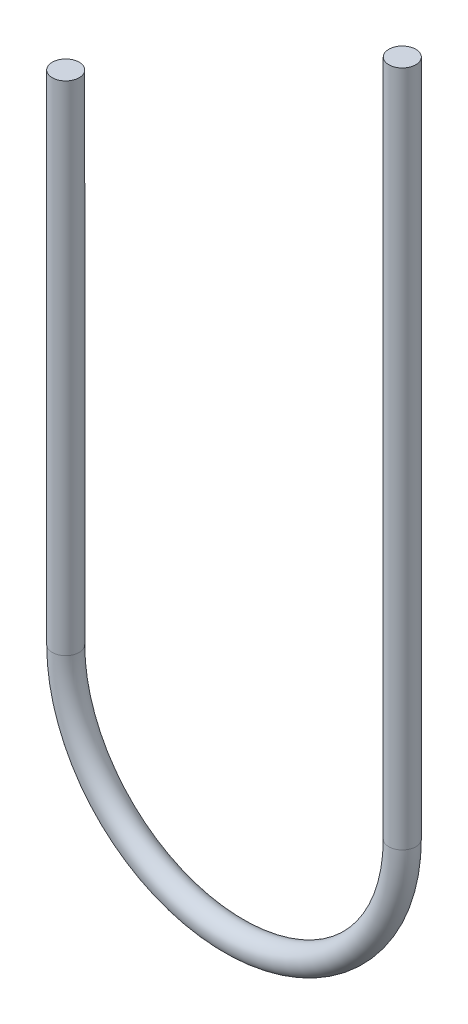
ISO-10303-21;
HEADER;
FILE_DESCRIPTION(('STEP AP214'),'2;1');
FILE_NAME('part.step','',(''),(''),'','','');
FILE_SCHEMA(('AUTOMOTIVE_DESIGN { 1 0 10303 214 1 1 1 1 }'));
ENDSEC;
DATA;
#1=APPLICATION_CONTEXT('core data for automotive mechanical design processes');
#2=APPLICATION_PROTOCOL_DEFINITION('international standard','automotive_design',2000,#1);
#3=PRODUCT_CONTEXT('',#1,'mechanical');
#4=PRODUCT('Part','Part','',(#3));
#5=PRODUCT_RELATED_PRODUCT_CATEGORY('part','',(#4));
#6=PRODUCT_DEFINITION_FORMATION('','',#4);
#7=PRODUCT_DEFINITION_CONTEXT('part definition',#1,'design');
#8=PRODUCT_DEFINITION('design','',#6,#7);
#9=PRODUCT_DEFINITION_SHAPE('','',#8);
#10=(LENGTH_UNIT() NAMED_UNIT(*) SI_UNIT(.MILLI.,.METRE.));
#11=(NAMED_UNIT(*) PLANE_ANGLE_UNIT() SI_UNIT($,.RADIAN.));
#12=(NAMED_UNIT(*) SI_UNIT($,.STERADIAN.) SOLID_ANGLE_UNIT());
#13=UNCERTAINTY_MEASURE_WITH_UNIT(LENGTH_MEASURE(1.E-05),#10,'distance_accuracy_value','');
#14=(GEOMETRIC_REPRESENTATION_CONTEXT(3) GLOBAL_UNCERTAINTY_ASSIGNED_CONTEXT((#13)) GLOBAL_UNIT_ASSIGNED_CONTEXT((#10,
#11,#12)) REPRESENTATION_CONTEXT('',''));
#15=CARTESIAN_POINT('',(0.,0.,0.));
#16=DIRECTION('',(0.,0.,1.));
#17=DIRECTION('',(1.,0.,0.));
#18=AXIS2_PLACEMENT_3D('',#15,#16,#17);
#19=CARTESIAN_POINT('',(-57.1499999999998,-229.7719948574,0.));
#20=DIRECTION('',(0.,1.,0.));
#21=DIRECTION('',(-1.,0.,0.));
#22=AXIS2_PLACEMENT_3D('',#19,#20,#21);
#23=CYLINDRICAL_SURFACE('',#22,3.80999999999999);
#24=CARTESIAN_POINT('',(-57.1499999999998,-229.7719948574,0.));
#25=DIRECTION('',(0.,1.,0.));
#26=DIRECTION('',(0.,0.,-1.));
#27=AXIS2_PLACEMENT_3D('',#24,#25,#26);
#28=CIRCLE('',#27,3.80999999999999);
#29=CARTESIAN_POINT('',(-60.9599999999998,-229.7719948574,0.));
#30=VERTEX_POINT('',#29);
#31=EDGE_CURVE('E35',#30,#30,#28,.T.);
#32=ORIENTED_EDGE('',*,*,#31,.T.);
#33=EDGE_LOOP('',(#32));
#34=FACE_BOUND('',#33,.T.);
#35=CARTESIAN_POINT('',(-57.1499999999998,-88.9,0.));
#36=DIRECTION('',(0.,1.,0.));
#37=DIRECTION('',(0.,0.,-1.));
#38=AXIS2_PLACEMENT_3D('',#35,#36,#37);
#39=CIRCLE('',#38,3.80999999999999);
#40=CARTESIAN_POINT('',(-57.1499999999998,-88.9,-3.81000000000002));
#41=VERTEX_POINT('',#40);
#42=EDGE_CURVE('E10',#41,#41,#39,.T.);
#43=ORIENTED_EDGE('',*,*,#42,.F.);
#44=EDGE_LOOP('',(#43));
#45=FACE_BOUND('',#44,.T.);
#46=ADVANCED_FACE('F29',(#34,#45),#23,.T.);
#47=CARTESIAN_POINT('',(-9.52499999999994,-229.7719948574,0.));
#48=DIRECTION('',(0.,0.,-1.));
#49=DIRECTION('',(-1.,0.,0.));
#50=AXIS2_PLACEMENT_3D('',#47,#48,#49);
#51=TOROIDAL_SURFACE('',#50,47.6249999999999,3.80999999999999);
#52=CARTESIAN_POINT('',(38.0999999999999,-229.7719948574,0.));
#53=DIRECTION('',(0.,-1.,0.));
#54=DIRECTION('',(0.,0.,-1.));
#55=AXIS2_PLACEMENT_3D('',#52,#53,#54);
#56=CIRCLE('',#55,3.80999999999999);
#57=CARTESIAN_POINT('',(41.9099999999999,-229.7719948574,0.));
#58=VERTEX_POINT('',#57);
#59=EDGE_CURVE('E39',#58,#58,#56,.T.);
#60=CARTESIAN_POINT('',(-9.52499999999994,-229.7719948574,0.));
#61=DIRECTION('',(0.,0.,-1.));
#62=DIRECTION('',(-1.,0.,0.));
#63=AXIS2_PLACEMENT_3D('',#60,#61,#62);
#64=CIRCLE('',#63,51.4349999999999);
#65=EDGE_CURVE('',#58,#30,#64,.T.);
#66=ORIENTED_EDGE('',*,*,#59,.T.);
#67=ORIENTED_EDGE('',*,*,#31,.F.);
#68=ORIENTED_EDGE('',*,*,#65,.T.);
#69=ORIENTED_EDGE('',*,*,#65,.F.);
#70=EDGE_LOOP('',(#66,#68,#67,#69));
#71=FACE_BOUND('',#70,.T.);
#72=ADVANCED_FACE('F61',(#71),#51,.T.);
#73=CARTESIAN_POINT('',(38.0999999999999,-229.7719948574,0.));
#74=DIRECTION('',(0.,1.,0.));
#75=DIRECTION('',(0.,0.,1.));
#76=AXIS2_PLACEMENT_3D('',#73,#74,#75);
#77=CYLINDRICAL_SURFACE('',#76,3.80999999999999);
#78=ORIENTED_EDGE('',*,*,#59,.F.);
#79=EDGE_LOOP('',(#78));
#80=FACE_BOUND('',#79,.T.);
#81=CARTESIAN_POINT('',(38.0999999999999,-38.1,0.));
#82=DIRECTION('',(0.,-1.,0.));
#83=DIRECTION('',(0.,0.,-1.));
#84=AXIS2_PLACEMENT_3D('',#81,#82,#83);
#85=CIRCLE('',#84,3.80999999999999);
#86=CARTESIAN_POINT('',(38.0999999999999,-38.1,-3.81000000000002));
#87=VERTEX_POINT('',#86);
#88=EDGE_CURVE('E43',#87,#87,#85,.T.);
#89=ORIENTED_EDGE('',*,*,#88,.T.);
#90=EDGE_LOOP('',(#89));
#91=FACE_BOUND('',#90,.T.);
#92=ADVANCED_FACE('F49',(#80,#91),#77,.T.);
#93=CARTESIAN_POINT('',(-57.1499999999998,-88.9,0.));
#94=DIRECTION('',(0.,1.,0.));
#95=DIRECTION('',(0.,0.,-1.));
#96=AXIS2_PLACEMENT_3D('',#93,#94,#95);
#97=PLANE('',#96);
#98=ORIENTED_EDGE('',*,*,#42,.T.);
#99=EDGE_LOOP('',(#98));
#100=FACE_BOUND('',#99,.T.);
#101=ADVANCED_FACE('F53',(#100),#97,.T.);
#102=CARTESIAN_POINT('',(38.0999999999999,-38.1,0.));
#103=DIRECTION('',(0.,-1.,0.));
#104=DIRECTION('',(0.,0.,-1.));
#105=AXIS2_PLACEMENT_3D('',#102,#103,#104);
#106=PLANE('',#105);
#107=ORIENTED_EDGE('',*,*,#88,.F.);
#108=EDGE_LOOP('',(#107));
#109=FACE_BOUND('',#108,.T.);
#110=ADVANCED_FACE('F51',(#109),#106,.F.);
#111=CLOSED_SHELL('',(#46,#72,#92,#101,#110));
#112=MANIFOLD_SOLID_BREP('B2',#111);
#113=ADVANCED_BREP_SHAPE_REPRESENTATION('',(#18,#112),#14);
#114=SHAPE_DEFINITION_REPRESENTATION(#9,#113);
ENDSEC;
END-ISO-10303-21;
